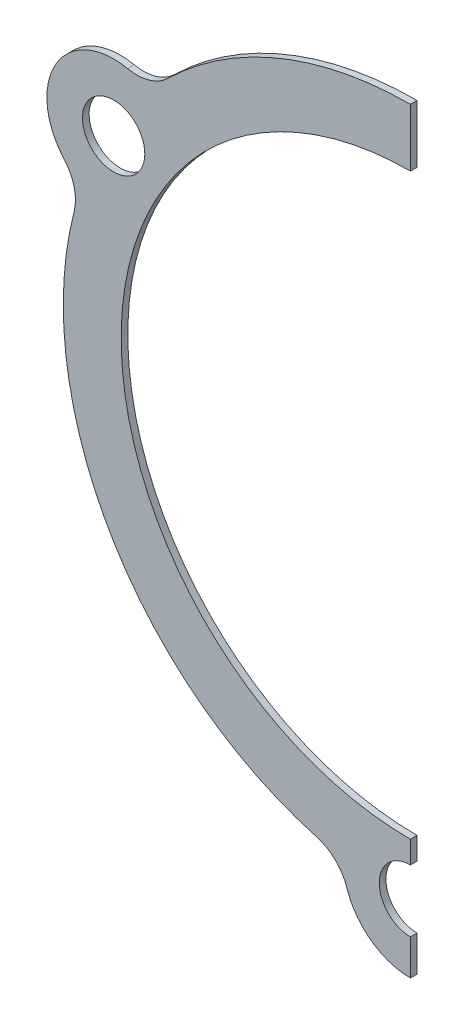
ISO-10303-21;
HEADER;
FILE_DESCRIPTION(('STEP AP214'),'2;1');
FILE_NAME('part.step','',(''),(''),'','','');
FILE_SCHEMA(('AUTOMOTIVE_DESIGN { 1 0 10303 214 1 1 1 1 }'));
ENDSEC;
DATA;
#1=APPLICATION_CONTEXT('core data for automotive mechanical design processes');
#2=APPLICATION_PROTOCOL_DEFINITION('international standard','automotive_design',2000,#1);
#3=PRODUCT_CONTEXT('',#1,'mechanical');
#4=PRODUCT('Part','Part','',(#3));
#5=PRODUCT_RELATED_PRODUCT_CATEGORY('part','',(#4));
#6=PRODUCT_DEFINITION_FORMATION('','',#4);
#7=PRODUCT_DEFINITION_CONTEXT('part definition',#1,'design');
#8=PRODUCT_DEFINITION('design','',#6,#7);
#9=PRODUCT_DEFINITION_SHAPE('','',#8);
#10=(LENGTH_UNIT() NAMED_UNIT(*) SI_UNIT(.MILLI.,.METRE.));
#11=(NAMED_UNIT(*) PLANE_ANGLE_UNIT() SI_UNIT($,.RADIAN.));
#12=(NAMED_UNIT(*) SI_UNIT($,.STERADIAN.) SOLID_ANGLE_UNIT());
#13=UNCERTAINTY_MEASURE_WITH_UNIT(LENGTH_MEASURE(1.E-05),#10,'distance_accuracy_value','');
#14=(GEOMETRIC_REPRESENTATION_CONTEXT(3) GLOBAL_UNCERTAINTY_ASSIGNED_CONTEXT((#13)) GLOBAL_UNIT_ASSIGNED_CONTEXT((#10,
#11,#12)) REPRESENTATION_CONTEXT('',''));
#15=CARTESIAN_POINT('',(0.,0.,0.));
#16=DIRECTION('',(0.,0.,1.));
#17=DIRECTION('',(1.,0.,0.));
#18=AXIS2_PLACEMENT_3D('',#15,#16,#17);
#19=CARTESIAN_POINT('',(11.8879062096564,-80.8636363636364,1.5));
#20=DIRECTION('',(0.,0.,1.));
#21=DIRECTION('',(1.,0.,0.));
#22=AXIS2_PLACEMENT_3D('',#19,#20,#21);
#23=PLANE('',#22);
#24=DIRECTION('',(0.,1.,0.));
#25=VECTOR('',#24,1.);
#26=CARTESIAN_POINT('',(0.,80.,1.5));
#27=LINE('',#26,#25);
#28=CARTESIAN_POINT('',(0.,65.,1.5));
#29=VERTEX_POINT('',#28);
#30=CARTESIAN_POINT('',(0.,78.,1.5));
#31=VERTEX_POINT('',#30);
#32=EDGE_CURVE('E39',#29,#31,#27,.T.);
#33=ORIENTED_EDGE('',*,*,#32,.T.);
#34=CARTESIAN_POINT('',(0.,0.,1.5));
#35=DIRECTION('',(0.,0.,1.));
#36=DIRECTION('',(1.,0.,0.));
#37=AXIS2_PLACEMENT_3D('',#34,#35,#36);
#38=CIRCLE('',#37,78.);
#39=CARTESIAN_POINT('',(-54.500784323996,55.8002196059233,1.5));
#40=VERTEX_POINT('',#39);
#41=EDGE_CURVE('E142',#31,#40,#38,.T.);
#42=ORIENTED_EDGE('',*,*,#41,.T.);
#43=CARTESIAN_POINT('',(-61.488064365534,62.9540939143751,1.5));
#44=DIRECTION('',(0.,0.,-1.));
#45=DIRECTION('',(-1.,0.,0.));
#46=AXIS2_PLACEMENT_3D('',#43,#44,#45);
#47=CIRCLE('',#46,10.);
#48=CARTESIAN_POINT('',(-63.566421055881,53.1724563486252,1.5));
#49=VERTEX_POINT('',#48);
#50=EDGE_CURVE('E145',#40,#49,#47,.T.);
#51=ORIENTED_EDGE('',*,*,#50,.T.);
#52=CARTESIAN_POINT('',(-66.6839560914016,38.5000000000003,1.5));
#53=DIRECTION('',(0.,0.,1.));
#54=DIRECTION('',(1.,0.,0.));
#55=AXIS2_PLACEMENT_3D('',#52,#53,#54);
#56=CIRCLE('',#55,15.);
#57=CARTESIAN_POINT('',(-77.8319085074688,28.4639072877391,1.5));
#58=VERTEX_POINT('',#57);
#59=EDGE_CURVE('E152',#49,#58,#56,.T.);
#60=ORIENTED_EDGE('',*,*,#59,.T.);
#61=CARTESIAN_POINT('',(-85.2638767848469,21.7731788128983,1.5));
#62=DIRECTION('',(0.,0.,-1.));
#63=DIRECTION('',(1.,0.,0.));
#64=AXIS2_PLACEMENT_3D('',#61,#62,#63);
#65=CIRCLE('',#64,10.);
#66=CARTESIAN_POINT('',(-75.5747998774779,19.2989539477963,1.5));
#67=VERTEX_POINT('',#66);
#68=EDGE_CURVE('E154',#58,#67,#65,.T.);
#69=ORIENTED_EDGE('',*,*,#68,.T.);
#70=CARTESIAN_POINT('',(0.,0.,1.5));
#71=DIRECTION('',(0.,0.,1.));
#72=DIRECTION('',(1.,0.,0.));
#73=AXIS2_PLACEMENT_3D('',#70,#71,#72);
#74=CIRCLE('',#73,78.);
#75=CARTESIAN_POINT('',(-21.0740155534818,-75.099173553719,1.5));
#76=VERTEX_POINT('',#75);
#77=EDGE_CURVE('E156',#67,#76,#74,.T.);
#78=ORIENTED_EDGE('',*,*,#77,.T.);
#79=CARTESIAN_POINT('',(-23.7758124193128,-84.7272727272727,1.5));
#80=DIRECTION('',(0.,0.,-1.));
#81=DIRECTION('',(-1.,0.,0.));
#82=AXIS2_PLACEMENT_3D('',#79,#80,#81);
#83=CIRCLE('',#82,10.);
#84=CARTESIAN_POINT('',(-14.2654874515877,-81.6363636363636,1.5));
#85=VERTEX_POINT('',#84);
#86=EDGE_CURVE('E158',#76,#85,#83,.T.);
#87=ORIENTED_EDGE('',*,*,#86,.T.);
#88=CARTESIAN_POINT('',(0.,-77.,1.5));
#89=DIRECTION('',(0.,0.,1.));
#90=DIRECTION('',(1.,0.,0.));
#91=AXIS2_PLACEMENT_3D('',#88,#89,#90);
#92=CIRCLE('',#91,15.);
#93=CARTESIAN_POINT('',(0.,-92.,1.5));
#94=VERTEX_POINT('',#93);
#95=EDGE_CURVE('E160',#85,#94,#92,.T.);
#96=ORIENTED_EDGE('',*,*,#95,.T.);
#97=CARTESIAN_POINT('',(0.,-84.,1.5));
#98=VERTEX_POINT('',#97);
#99=EDGE_CURVE('E117',#94,#98,#27,.T.);
#100=ORIENTED_EDGE('',*,*,#99,.T.);
#101=CARTESIAN_POINT('',(0.,-77.,1.5));
#102=DIRECTION('',(0.,0.,1.));
#103=DIRECTION('',(1.,0.,0.));
#104=AXIS2_PLACEMENT_3D('',#101,#102,#103);
#105=CIRCLE('',#104,7.);
#106=CARTESIAN_POINT('',(0.,-70.,1.5));
#107=VERTEX_POINT('',#106);
#108=EDGE_CURVE('E181',#107,#98,#105,.T.);
#109=ORIENTED_EDGE('',*,*,#108,.F.);
#110=CARTESIAN_POINT('',(0.,-65.,1.5));
#111=VERTEX_POINT('',#110);
#112=EDGE_CURVE('E47',#107,#111,#27,.T.);
#113=ORIENTED_EDGE('',*,*,#112,.T.);
#114=CARTESIAN_POINT('',(0.,0.,1.5));
#115=DIRECTION('',(0.,0.,1.));
#116=DIRECTION('',(1.,0.,0.));
#117=AXIS2_PLACEMENT_3D('',#114,#115,#116);
#118=CIRCLE('',#117,65.);
#119=EDGE_CURVE('E197',#29,#111,#118,.T.);
#120=ORIENTED_EDGE('',*,*,#119,.F.);
#121=EDGE_LOOP('',(#33,#42,#51,#60,#69,#78,#87,#96,#100,#109,#113,#120));
#122=FACE_BOUND('',#121,.T.);
#123=CARTESIAN_POINT('',(-66.6839560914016,38.5000000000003,1.5));
#124=DIRECTION('',(0.,0.,1.));
#125=DIRECTION('',(-0.500000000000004,-0.866025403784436,0.));
#126=AXIS2_PLACEMENT_3D('',#123,#124,#125);
#127=CIRCLE('',#126,7.);
#128=CARTESIAN_POINT('',(-70.1839560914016,32.4378221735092,1.5));
#129=VERTEX_POINT('',#128);
#130=EDGE_CURVE('E191',#129,#129,#127,.T.);
#131=ORIENTED_EDGE('',*,*,#130,.F.);
#132=EDGE_LOOP('',(#131));
#133=FACE_BOUND('',#132,.T.);
#134=ADVANCED_FACE('F24',(#122,#133),#23,.T.);
#135=CARTESIAN_POINT('',(11.8879062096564,-80.8636363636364,0.));
#136=DIRECTION('',(0.,0.,1.));
#137=DIRECTION('',(1.,0.,0.));
#138=AXIS2_PLACEMENT_3D('',#135,#136,#137);
#139=PLANE('',#138);
#140=CARTESIAN_POINT('',(-66.6839560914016,38.5000000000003,0.));
#141=DIRECTION('',(0.,0.,1.));
#142=DIRECTION('',(-0.500000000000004,-0.866025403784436,0.));
#143=AXIS2_PLACEMENT_3D('',#140,#141,#142);
#144=CIRCLE('',#143,7.);
#145=CARTESIAN_POINT('',(-70.1839560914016,32.4378221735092,0.));
#146=VERTEX_POINT('',#145);
#147=EDGE_CURVE('E186',#146,#146,#144,.T.);
#148=ORIENTED_EDGE('',*,*,#147,.T.);
#149=EDGE_LOOP('',(#148));
#150=FACE_BOUND('',#149,.T.);
#151=CARTESIAN_POINT('',(0.,0.,0.));
#152=DIRECTION('',(0.,0.,1.));
#153=DIRECTION('',(1.,0.,0.));
#154=AXIS2_PLACEMENT_3D('',#151,#152,#153);
#155=CIRCLE('',#154,78.);
#156=CARTESIAN_POINT('',(0.,78.,0.));
#157=VERTEX_POINT('',#156);
#158=CARTESIAN_POINT('',(-54.500784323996,55.8002196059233,0.));
#159=VERTEX_POINT('',#158);
#160=EDGE_CURVE('E199',#157,#159,#155,.T.);
#161=ORIENTED_EDGE('',*,*,#160,.F.);
#162=DIRECTION('',(0.,1.,0.));
#163=VECTOR('',#162,1.);
#164=CARTESIAN_POINT('',(0.,80.,0.));
#165=LINE('',#164,#163);
#166=CARTESIAN_POINT('',(0.,65.,0.));
#167=VERTEX_POINT('',#166);
#168=EDGE_CURVE('E137',#167,#157,#165,.T.);
#169=ORIENTED_EDGE('',*,*,#168,.F.);
#170=CARTESIAN_POINT('',(0.,0.,0.));
#171=DIRECTION('',(0.,0.,1.));
#172=DIRECTION('',(1.,0.,0.));
#173=AXIS2_PLACEMENT_3D('',#170,#171,#172);
#174=CIRCLE('',#173,65.);
#175=CARTESIAN_POINT('',(0.,-65.,0.));
#176=VERTEX_POINT('',#175);
#177=EDGE_CURVE('E188',#167,#176,#174,.T.);
#178=ORIENTED_EDGE('',*,*,#177,.T.);
#179=CARTESIAN_POINT('',(0.,-70.,0.));
#180=VERTEX_POINT('',#179);
#181=EDGE_CURVE('E135',#180,#176,#165,.T.);
#182=ORIENTED_EDGE('',*,*,#181,.F.);
#183=CARTESIAN_POINT('',(0.,-77.,0.));
#184=DIRECTION('',(0.,0.,1.));
#185=DIRECTION('',(1.,0.,0.));
#186=AXIS2_PLACEMENT_3D('',#183,#184,#185);
#187=CIRCLE('',#186,7.);
#188=CARTESIAN_POINT('',(0.,-84.,0.));
#189=VERTEX_POINT('',#188);
#190=EDGE_CURVE('E134',#180,#189,#187,.T.);
#191=ORIENTED_EDGE('',*,*,#190,.T.);
#192=CARTESIAN_POINT('',(0.,-92.,0.));
#193=VERTEX_POINT('',#192);
#194=EDGE_CURVE('E115',#193,#189,#165,.T.);
#195=ORIENTED_EDGE('',*,*,#194,.F.);
#196=CARTESIAN_POINT('',(0.,-77.,0.));
#197=DIRECTION('',(0.,0.,1.));
#198=DIRECTION('',(1.,0.,0.));
#199=AXIS2_PLACEMENT_3D('',#196,#197,#198);
#200=CIRCLE('',#199,15.);
#201=CARTESIAN_POINT('',(-14.2654874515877,-81.6363636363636,0.));
#202=VERTEX_POINT('',#201);
#203=EDGE_CURVE('E131',#202,#193,#200,.T.);
#204=ORIENTED_EDGE('',*,*,#203,.F.);
#205=CARTESIAN_POINT('',(-23.7758124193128,-84.7272727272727,0.));
#206=DIRECTION('',(0.,0.,-1.));
#207=DIRECTION('',(-1.,0.,0.));
#208=AXIS2_PLACEMENT_3D('',#205,#206,#207);
#209=CIRCLE('',#208,10.);
#210=CARTESIAN_POINT('',(-21.0740155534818,-75.099173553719,0.));
#211=VERTEX_POINT('',#210);
#212=EDGE_CURVE('E143',#211,#202,#209,.T.);
#213=ORIENTED_EDGE('',*,*,#212,.F.);
#214=CARTESIAN_POINT('',(0.,0.,0.));
#215=DIRECTION('',(0.,0.,1.));
#216=DIRECTION('',(1.,0.,0.));
#217=AXIS2_PLACEMENT_3D('',#214,#215,#216);
#218=CIRCLE('',#217,78.);
#219=CARTESIAN_POINT('',(-75.5747998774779,19.2989539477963,0.));
#220=VERTEX_POINT('',#219);
#221=EDGE_CURVE('E147',#220,#211,#218,.T.);
#222=ORIENTED_EDGE('',*,*,#221,.F.);
#223=CARTESIAN_POINT('',(-85.2638767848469,21.7731788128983,0.));
#224=DIRECTION('',(0.,0.,-1.));
#225=DIRECTION('',(1.,0.,0.));
#226=AXIS2_PLACEMENT_3D('',#223,#224,#225);
#227=CIRCLE('',#226,10.);
#228=CARTESIAN_POINT('',(-77.8319085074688,28.4639072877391,0.));
#229=VERTEX_POINT('',#228);
#230=EDGE_CURVE('E205',#229,#220,#227,.T.);
#231=ORIENTED_EDGE('',*,*,#230,.F.);
#232=CARTESIAN_POINT('',(-66.6839560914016,38.5000000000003,0.));
#233=DIRECTION('',(0.,0.,1.));
#234=DIRECTION('',(1.,0.,0.));
#235=AXIS2_PLACEMENT_3D('',#232,#233,#234);
#236=CIRCLE('',#235,15.);
#237=CARTESIAN_POINT('',(-63.566421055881,53.1724563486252,0.));
#238=VERTEX_POINT('',#237);
#239=EDGE_CURVE('E203',#238,#229,#236,.T.);
#240=ORIENTED_EDGE('',*,*,#239,.F.);
#241=CARTESIAN_POINT('',(-61.488064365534,62.9540939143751,0.));
#242=DIRECTION('',(0.,0.,-1.));
#243=DIRECTION('',(-1.,0.,0.));
#244=AXIS2_PLACEMENT_3D('',#241,#242,#243);
#245=CIRCLE('',#244,10.);
#246=EDGE_CURVE('E201',#159,#238,#245,.T.);
#247=ORIENTED_EDGE('',*,*,#246,.F.);
#248=EDGE_LOOP('',(#161,#169,#178,#182,#191,#195,#204,#213,#222,#231,#240,#247));
#249=FACE_BOUND('',#248,.T.);
#250=ADVANCED_FACE('F129',(#150,#249),#139,.F.);
#251=CARTESIAN_POINT('',(0.,0.,1.5));
#252=DIRECTION('',(0.,0.,-1.));
#253=DIRECTION('',(-1.,0.,0.));
#254=AXIS2_PLACEMENT_3D('',#251,#252,#253);
#255=CYLINDRICAL_SURFACE('',#254,78.);
#256=ORIENTED_EDGE('',*,*,#41,.F.);
#257=DIRECTION('',(0.,0.,-1.));
#258=VECTOR('',#257,1.);
#259=CARTESIAN_POINT('',(0.,78.,1.5));
#260=LINE('',#259,#258);
#261=EDGE_CURVE('E122',#31,#157,#260,.T.);
#262=ORIENTED_EDGE('',*,*,#261,.T.);
#263=ORIENTED_EDGE('',*,*,#160,.T.);
#264=DIRECTION('',(0.,0.,-1.));
#265=VECTOR('',#264,1.);
#266=CARTESIAN_POINT('',(-54.500784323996,55.8002196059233,1.5));
#267=LINE('',#266,#265);
#268=EDGE_CURVE('E175',#40,#159,#267,.T.);
#269=ORIENTED_EDGE('',*,*,#268,.F.);
#270=EDGE_LOOP('',(#256,#262,#263,#269));
#271=FACE_BOUND('',#270,.T.);
#272=ADVANCED_FACE('F26',(#271),#255,.T.);
#273=CARTESIAN_POINT('',(-61.488064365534,62.9540939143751,1.5));
#274=DIRECTION('',(0.,0.,-1.));
#275=DIRECTION('',(-1.,0.,0.));
#276=AXIS2_PLACEMENT_3D('',#273,#274,#275);
#277=CYLINDRICAL_SURFACE('',#276,10.);
#278=ORIENTED_EDGE('',*,*,#246,.T.);
#279=DIRECTION('',(0.,0.,-1.));
#280=VECTOR('',#279,1.);
#281=CARTESIAN_POINT('',(-63.566421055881,53.1724563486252,1.5));
#282=LINE('',#281,#280);
#283=EDGE_CURVE('E172',#49,#238,#282,.T.);
#284=ORIENTED_EDGE('',*,*,#283,.F.);
#285=ORIENTED_EDGE('',*,*,#50,.F.);
#286=ORIENTED_EDGE('',*,*,#268,.T.);
#287=EDGE_LOOP('',(#278,#284,#285,#286));
#288=FACE_BOUND('',#287,.T.);
#289=ADVANCED_FACE('F228',(#288),#277,.F.);
#290=CARTESIAN_POINT('',(-66.6839560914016,38.5000000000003,1.5));
#291=DIRECTION('',(0.,0.,-1.));
#292=DIRECTION('',(-1.,0.,0.));
#293=AXIS2_PLACEMENT_3D('',#290,#291,#292);
#294=CYLINDRICAL_SURFACE('',#293,15.);
#295=ORIENTED_EDGE('',*,*,#239,.T.);
#296=DIRECTION('',(0.,0.,-1.));
#297=VECTOR('',#296,1.);
#298=CARTESIAN_POINT('',(-77.8319085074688,28.4639072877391,1.5));
#299=LINE('',#298,#297);
#300=EDGE_CURVE('E169',#58,#229,#299,.T.);
#301=ORIENTED_EDGE('',*,*,#300,.F.);
#302=ORIENTED_EDGE('',*,*,#59,.F.);
#303=ORIENTED_EDGE('',*,*,#283,.T.);
#304=EDGE_LOOP('',(#295,#301,#302,#303));
#305=FACE_BOUND('',#304,.T.);
#306=ADVANCED_FACE('F224',(#305),#294,.T.);
#307=CARTESIAN_POINT('',(-85.2638767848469,21.7731788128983,1.5));
#308=DIRECTION('',(0.,0.,-1.));
#309=DIRECTION('',(-1.,0.,0.));
#310=AXIS2_PLACEMENT_3D('',#307,#308,#309);
#311=CYLINDRICAL_SURFACE('',#310,10.);
#312=ORIENTED_EDGE('',*,*,#230,.T.);
#313=DIRECTION('',(0.,0.,-1.));
#314=VECTOR('',#313,1.);
#315=CARTESIAN_POINT('',(-75.5747998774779,19.2989539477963,1.5));
#316=LINE('',#315,#314);
#317=EDGE_CURVE('E166',#67,#220,#316,.T.);
#318=ORIENTED_EDGE('',*,*,#317,.F.);
#319=ORIENTED_EDGE('',*,*,#68,.F.);
#320=ORIENTED_EDGE('',*,*,#300,.T.);
#321=EDGE_LOOP('',(#312,#318,#319,#320));
#322=FACE_BOUND('',#321,.T.);
#323=ADVANCED_FACE('F220',(#322),#311,.F.);
#324=CARTESIAN_POINT('',(0.,0.,1.5));
#325=DIRECTION('',(0.,0.,-1.));
#326=DIRECTION('',(-1.,0.,0.));
#327=AXIS2_PLACEMENT_3D('',#324,#325,#326);
#328=CYLINDRICAL_SURFACE('',#327,78.);
#329=ORIENTED_EDGE('',*,*,#221,.T.);
#330=DIRECTION('',(0.,0.,-1.));
#331=VECTOR('',#330,1.);
#332=CARTESIAN_POINT('',(-21.0740155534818,-75.099173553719,1.5));
#333=LINE('',#332,#331);
#334=EDGE_CURVE('E163',#76,#211,#333,.T.);
#335=ORIENTED_EDGE('',*,*,#334,.F.);
#336=ORIENTED_EDGE('',*,*,#77,.F.);
#337=ORIENTED_EDGE('',*,*,#317,.T.);
#338=EDGE_LOOP('',(#329,#335,#336,#337));
#339=FACE_BOUND('',#338,.T.);
#340=ADVANCED_FACE('F209',(#339),#328,.T.);
#341=CARTESIAN_POINT('',(-23.7758124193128,-84.7272727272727,1.5));
#342=DIRECTION('',(0.,0.,-1.));
#343=DIRECTION('',(-1.,0.,0.));
#344=AXIS2_PLACEMENT_3D('',#341,#342,#343);
#345=CYLINDRICAL_SURFACE('',#344,10.);
#346=ORIENTED_EDGE('',*,*,#212,.T.);
#347=DIRECTION('',(0.,0.,-1.));
#348=VECTOR('',#347,1.);
#349=CARTESIAN_POINT('',(-14.2654874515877,-81.6363636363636,1.5));
#350=LINE('',#349,#348);
#351=EDGE_CURVE('E141',#85,#202,#350,.T.);
#352=ORIENTED_EDGE('',*,*,#351,.F.);
#353=ORIENTED_EDGE('',*,*,#86,.F.);
#354=ORIENTED_EDGE('',*,*,#334,.T.);
#355=EDGE_LOOP('',(#346,#352,#353,#354));
#356=FACE_BOUND('',#355,.T.);
#357=ADVANCED_FACE('F215',(#356),#345,.F.);
#358=CARTESIAN_POINT('',(0.,-77.,1.5));
#359=DIRECTION('',(0.,0.,-1.));
#360=DIRECTION('',(-1.,0.,0.));
#361=AXIS2_PLACEMENT_3D('',#358,#359,#360);
#362=CYLINDRICAL_SURFACE('',#361,15.);
#363=ORIENTED_EDGE('',*,*,#203,.T.);
#364=DIRECTION('',(0.,0.,-1.));
#365=VECTOR('',#364,1.);
#366=CARTESIAN_POINT('',(0.,-92.,1.5));
#367=LINE('',#366,#365);
#368=EDGE_CURVE('E112',#193,#94,#367,.F.);
#369=ORIENTED_EDGE('',*,*,#368,.T.);
#370=ORIENTED_EDGE('',*,*,#95,.F.);
#371=ORIENTED_EDGE('',*,*,#351,.T.);
#372=EDGE_LOOP('',(#363,#369,#370,#371));
#373=FACE_BOUND('',#372,.T.);
#374=ADVANCED_FACE('F139',(#373),#362,.T.);
#375=CARTESIAN_POINT('',(0.,0.,1.5));
#376=DIRECTION('',(0.,0.,-1.));
#377=DIRECTION('',(-1.,0.,0.));
#378=AXIS2_PLACEMENT_3D('',#375,#376,#377);
#379=CYLINDRICAL_SURFACE('',#378,65.);
#380=DIRECTION('',(0.,0.,-1.));
#381=VECTOR('',#380,1.);
#382=CARTESIAN_POINT('',(0.,65.,1.5));
#383=LINE('',#382,#381);
#384=EDGE_CURVE('E123',#29,#167,#383,.T.);
#385=ORIENTED_EDGE('',*,*,#384,.F.);
#386=ORIENTED_EDGE('',*,*,#119,.T.);
#387=DIRECTION('',(0.,0.,-1.));
#388=VECTOR('',#387,1.);
#389=CARTESIAN_POINT('',(0.,-65.,1.5));
#390=LINE('',#389,#388);
#391=EDGE_CURVE('E238',#176,#111,#390,.F.);
#392=ORIENTED_EDGE('',*,*,#391,.F.);
#393=ORIENTED_EDGE('',*,*,#177,.F.);
#394=EDGE_LOOP('',(#385,#386,#392,#393));
#395=FACE_BOUND('',#394,.T.);
#396=ADVANCED_FACE('F237',(#395),#379,.F.);
#397=CARTESIAN_POINT('',(0.,-77.,0.));
#398=DIRECTION('',(0.,0.,1.));
#399=DIRECTION('',(1.,0.,0.));
#400=AXIS2_PLACEMENT_3D('',#397,#398,#399);
#401=CYLINDRICAL_SURFACE('',#400,7.);
#402=ORIENTED_EDGE('',*,*,#108,.T.);
#403=DIRECTION('',(0.,0.,1.));
#404=VECTOR('',#403,1.);
#405=CARTESIAN_POINT('',(0.,-84.,0.));
#406=LINE('',#405,#404);
#407=EDGE_CURVE('E11',#98,#189,#406,.F.);
#408=ORIENTED_EDGE('',*,*,#407,.T.);
#409=ORIENTED_EDGE('',*,*,#190,.F.);
#410=DIRECTION('',(0.,0.,1.));
#411=VECTOR('',#410,1.);
#412=CARTESIAN_POINT('',(0.,-70.,0.));
#413=LINE('',#412,#411);
#414=EDGE_CURVE('E32',#180,#107,#413,.T.);
#415=ORIENTED_EDGE('',*,*,#414,.T.);
#416=EDGE_LOOP('',(#402,#408,#409,#415));
#417=FACE_BOUND('',#416,.T.);
#418=ADVANCED_FACE('F180',(#417),#401,.F.);
#419=CARTESIAN_POINT('',(-66.6839560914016,38.5000000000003,0.));
#420=DIRECTION('',(0.,0.,1.));
#421=DIRECTION('',(1.,0.,0.));
#422=AXIS2_PLACEMENT_3D('',#419,#420,#421);
#423=CYLINDRICAL_SURFACE('',#422,7.);
#424=ORIENTED_EDGE('',*,*,#147,.F.);
#425=EDGE_LOOP('',(#424));
#426=FACE_BOUND('',#425,.T.);
#427=ORIENTED_EDGE('',*,*,#130,.T.);
#428=EDGE_LOOP('',(#427));
#429=FACE_BOUND('',#428,.T.);
#430=ADVANCED_FACE('F246',(#426,#429),#423,.F.);
#431=CARTESIAN_POINT('',(0.,80.,1.5));
#432=DIRECTION('',(-1.,0.,0.));
#433=DIRECTION('',(0.,0.,1.));
#434=AXIS2_PLACEMENT_3D('',#431,#432,#433);
#435=PLANE('',#434);
#436=ORIENTED_EDGE('',*,*,#391,.T.);
#437=ORIENTED_EDGE('',*,*,#112,.F.);
#438=ORIENTED_EDGE('',*,*,#414,.F.);
#439=ORIENTED_EDGE('',*,*,#181,.T.);
#440=EDGE_LOOP('',(#436,#437,#438,#439));
#441=FACE_BOUND('',#440,.T.);
#442=ADVANCED_FACE('F317',(#441),#435,.F.);
#443=ORIENTED_EDGE('',*,*,#194,.T.);
#444=ORIENTED_EDGE('',*,*,#407,.F.);
#445=ORIENTED_EDGE('',*,*,#99,.F.);
#446=ORIENTED_EDGE('',*,*,#368,.F.);
#447=EDGE_LOOP('',(#443,#444,#445,#446));
#448=FACE_BOUND('',#447,.T.);
#449=ADVANCED_FACE('F114',(#448),#435,.F.);
#450=ORIENTED_EDGE('',*,*,#32,.F.);
#451=ORIENTED_EDGE('',*,*,#384,.T.);
#452=ORIENTED_EDGE('',*,*,#168,.T.);
#453=ORIENTED_EDGE('',*,*,#261,.F.);
#454=EDGE_LOOP('',(#450,#451,#452,#453));
#455=FACE_BOUND('',#454,.T.);
#456=ADVANCED_FACE('F326',(#455),#435,.F.);
#457=CLOSED_SHELL('',(#134,#250,#272,#289,#306,#323,#340,#357,#374,#396,#418,#430,#442,#449,#456));
#458=MANIFOLD_SOLID_BREP('B2',#457);
#459=ADVANCED_BREP_SHAPE_REPRESENTATION('',(#18,#458),#14);
#460=SHAPE_DEFINITION_REPRESENTATION(#9,#459);
ENDSEC;
END-ISO-10303-21;
